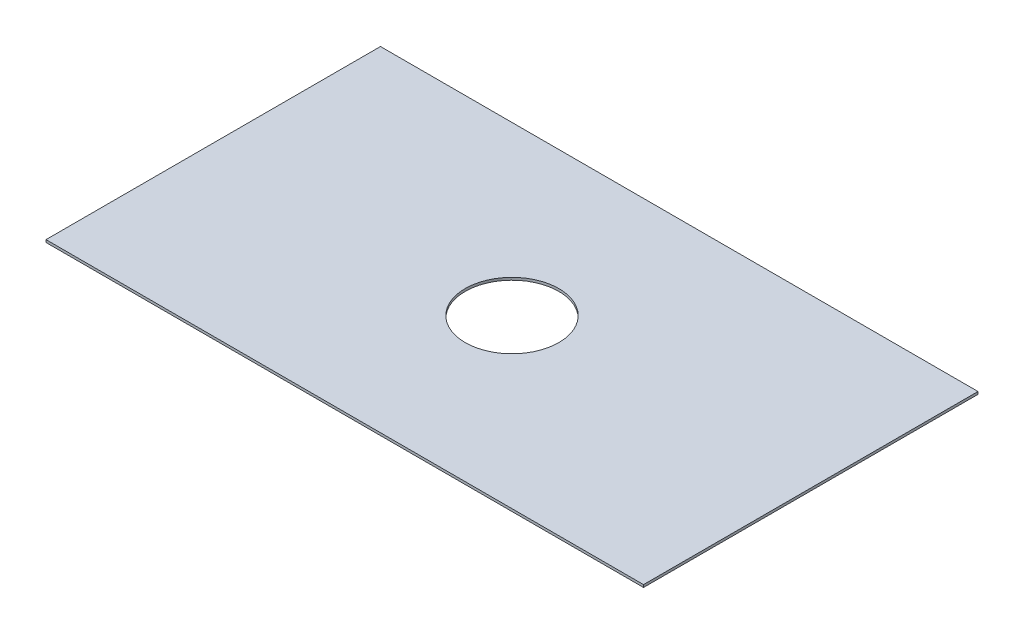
ISO-10303-21;
HEADER;
FILE_DESCRIPTION(('STEP AP214'),'2;1');
FILE_NAME('part.step','',(''),(''),'','','');
FILE_SCHEMA(('AUTOMOTIVE_DESIGN { 1 0 10303 214 1 1 1 1 }'));
ENDSEC;
DATA;
#1=APPLICATION_CONTEXT('core data for automotive mechanical design processes');
#2=APPLICATION_PROTOCOL_DEFINITION('international standard','automotive_design',2000,#1);
#3=PRODUCT_CONTEXT('',#1,'mechanical');
#4=PRODUCT('Part','Part','',(#3));
#5=PRODUCT_RELATED_PRODUCT_CATEGORY('part','',(#4));
#6=PRODUCT_DEFINITION_FORMATION('','',#4);
#7=PRODUCT_DEFINITION_CONTEXT('part definition',#1,'design');
#8=PRODUCT_DEFINITION('design','',#6,#7);
#9=PRODUCT_DEFINITION_SHAPE('','',#8);
#10=(LENGTH_UNIT() NAMED_UNIT(*) SI_UNIT(.MILLI.,.METRE.));
#11=(NAMED_UNIT(*) PLANE_ANGLE_UNIT() SI_UNIT($,.RADIAN.));
#12=(NAMED_UNIT(*) SI_UNIT($,.STERADIAN.) SOLID_ANGLE_UNIT());
#13=UNCERTAINTY_MEASURE_WITH_UNIT(LENGTH_MEASURE(1.E-05),#10,'distance_accuracy_value','');
#14=(GEOMETRIC_REPRESENTATION_CONTEXT(3) GLOBAL_UNCERTAINTY_ASSIGNED_CONTEXT((#13)) GLOBAL_UNIT_ASSIGNED_CONTEXT((#10,
#11,#12)) REPRESENTATION_CONTEXT('',''));
#15=CARTESIAN_POINT('',(0.,0.,0.));
#16=DIRECTION('',(0.,0.,1.));
#17=DIRECTION('',(1.,0.,0.));
#18=AXIS2_PLACEMENT_3D('',#15,#16,#17);
#19=CARTESIAN_POINT('',(-178.65,1.5,-100.));
#20=DIRECTION('',(0.,1.,0.));
#21=DIRECTION('',(0.,0.,1.));
#22=AXIS2_PLACEMENT_3D('',#19,#20,#21);
#23=PLANE('',#22);
#24=DIRECTION('',(0.,0.,1.));
#25=VECTOR('',#24,1.);
#26=CARTESIAN_POINT('',(-178.65,1.5,-100.));
#27=LINE('',#26,#25);
#28=CARTESIAN_POINT('',(-178.65,1.5,-100.));
#29=VERTEX_POINT('',#28);
#30=CARTESIAN_POINT('',(-178.65,1.5,100.));
#31=VERTEX_POINT('',#30);
#32=EDGE_CURVE('E101',#29,#31,#27,.T.);
#33=ORIENTED_EDGE('',*,*,#32,.T.);
#34=DIRECTION('',(1.,0.,0.));
#35=VECTOR('',#34,1.);
#36=CARTESIAN_POINT('',(-178.65,1.5,100.));
#37=LINE('',#36,#35);
#38=CARTESIAN_POINT('',(178.65,1.5,100.));
#39=VERTEX_POINT('',#38);
#40=EDGE_CURVE('E86',#31,#39,#37,.T.);
#41=ORIENTED_EDGE('',*,*,#40,.T.);
#42=DIRECTION('',(0.,0.,-1.));
#43=VECTOR('',#42,1.);
#44=CARTESIAN_POINT('',(178.65,1.5,-100.));
#45=LINE('',#44,#43);
#46=CARTESIAN_POINT('',(178.65,1.5,-100.));
#47=VERTEX_POINT('',#46);
#48=EDGE_CURVE('E52',#39,#47,#45,.T.);
#49=ORIENTED_EDGE('',*,*,#48,.T.);
#50=DIRECTION('',(-1.,0.,0.));
#51=VECTOR('',#50,1.);
#52=CARTESIAN_POINT('',(-178.65,1.5,-100.));
#53=LINE('',#52,#51);
#54=EDGE_CURVE('E47',#47,#29,#53,.T.);
#55=ORIENTED_EDGE('',*,*,#54,.T.);
#56=EDGE_LOOP('',(#33,#41,#49,#55));
#57=FACE_BOUND('',#56,.T.);
#58=CARTESIAN_POINT('',(0.,1.5,0.));
#59=DIRECTION('',(0.,1.,0.));
#60=DIRECTION('',(0.,0.,1.));
#61=AXIS2_PLACEMENT_3D('',#58,#59,#60);
#62=CIRCLE('',#61,28.);
#63=CARTESIAN_POINT('',(0.,1.5,28.));
#64=VERTEX_POINT('',#63);
#65=EDGE_CURVE('E91',#64,#64,#62,.T.);
#66=ORIENTED_EDGE('',*,*,#65,.F.);
#67=EDGE_LOOP('',(#66));
#68=FACE_BOUND('',#67,.T.);
#69=ADVANCED_FACE('F32',(#57,#68),#23,.T.);
#70=CARTESIAN_POINT('',(-178.65,0.,-100.));
#71=DIRECTION('',(0.,1.,0.));
#72=DIRECTION('',(0.,0.,1.));
#73=AXIS2_PLACEMENT_3D('',#70,#71,#72);
#74=PLANE('',#73);
#75=DIRECTION('',(0.,0.,1.));
#76=VECTOR('',#75,1.);
#77=CARTESIAN_POINT('',(-178.65,0.,-100.));
#78=LINE('',#77,#76);
#79=CARTESIAN_POINT('',(-178.65,0.,-100.));
#80=VERTEX_POINT('',#79);
#81=CARTESIAN_POINT('',(-178.65,0.,100.));
#82=VERTEX_POINT('',#81);
#83=EDGE_CURVE('E78',#80,#82,#78,.T.);
#84=ORIENTED_EDGE('',*,*,#83,.F.);
#85=DIRECTION('',(-1.,0.,0.));
#86=VECTOR('',#85,1.);
#87=CARTESIAN_POINT('',(-178.65,0.,-100.));
#88=LINE('',#87,#86);
#89=CARTESIAN_POINT('',(178.65,0.,-100.));
#90=VERTEX_POINT('',#89);
#91=EDGE_CURVE('E99',#90,#80,#88,.T.);
#92=ORIENTED_EDGE('',*,*,#91,.F.);
#93=DIRECTION('',(0.,0.,-1.));
#94=VECTOR('',#93,1.);
#95=CARTESIAN_POINT('',(178.65,0.,-100.));
#96=LINE('',#95,#94);
#97=CARTESIAN_POINT('',(178.65,0.,100.));
#98=VERTEX_POINT('',#97);
#99=EDGE_CURVE('E79',#98,#90,#96,.T.);
#100=ORIENTED_EDGE('',*,*,#99,.F.);
#101=DIRECTION('',(1.,0.,0.));
#102=VECTOR('',#101,1.);
#103=CARTESIAN_POINT('',(-178.65,0.,100.));
#104=LINE('',#103,#102);
#105=EDGE_CURVE('E73',#82,#98,#104,.T.);
#106=ORIENTED_EDGE('',*,*,#105,.F.);
#107=EDGE_LOOP('',(#84,#92,#100,#106));
#108=FACE_BOUND('',#107,.T.);
#109=CARTESIAN_POINT('',(0.,0.,0.));
#110=DIRECTION('',(0.,1.,0.));
#111=DIRECTION('',(0.,0.,1.));
#112=AXIS2_PLACEMENT_3D('',#109,#110,#111);
#113=CIRCLE('',#112,28.);
#114=CARTESIAN_POINT('',(0.,0.,28.));
#115=VERTEX_POINT('',#114);
#116=EDGE_CURVE('E94',#115,#115,#113,.T.);
#117=ORIENTED_EDGE('',*,*,#116,.T.);
#118=EDGE_LOOP('',(#117));
#119=FACE_BOUND('',#118,.T.);
#120=ADVANCED_FACE('F74',(#108,#119),#74,.F.);
#121=CARTESIAN_POINT('',(-178.65,1.5,-100.));
#122=DIRECTION('',(1.,0.,0.));
#123=DIRECTION('',(0.,0.,-1.));
#124=AXIS2_PLACEMENT_3D('',#121,#122,#123);
#125=PLANE('',#124);
#126=ORIENTED_EDGE('',*,*,#83,.T.);
#127=DIRECTION('',(0.,-1.,0.));
#128=VECTOR('',#127,1.);
#129=CARTESIAN_POINT('',(-178.65,1.5,100.));
#130=LINE('',#129,#128);
#131=EDGE_CURVE('E11',#31,#82,#130,.T.);
#132=ORIENTED_EDGE('',*,*,#131,.F.);
#133=ORIENTED_EDGE('',*,*,#32,.F.);
#134=DIRECTION('',(0.,-1.,0.));
#135=VECTOR('',#134,1.);
#136=CARTESIAN_POINT('',(-178.65,1.5,-100.));
#137=LINE('',#136,#135);
#138=EDGE_CURVE('E90',#29,#80,#137,.T.);
#139=ORIENTED_EDGE('',*,*,#138,.T.);
#140=EDGE_LOOP('',(#126,#132,#133,#139));
#141=FACE_BOUND('',#140,.T.);
#142=ADVANCED_FACE('F34',(#141),#125,.F.);
#143=CARTESIAN_POINT('',(-178.65,1.5,100.));
#144=DIRECTION('',(0.,0.,-1.));
#145=DIRECTION('',(-1.,0.,0.));
#146=AXIS2_PLACEMENT_3D('',#143,#144,#145);
#147=PLANE('',#146);
#148=ORIENTED_EDGE('',*,*,#105,.T.);
#149=DIRECTION('',(0.,-1.,0.));
#150=VECTOR('',#149,1.);
#151=CARTESIAN_POINT('',(178.65,1.5,100.));
#152=LINE('',#151,#150);
#153=EDGE_CURVE('E40',#39,#98,#152,.T.);
#154=ORIENTED_EDGE('',*,*,#153,.F.);
#155=ORIENTED_EDGE('',*,*,#40,.F.);
#156=ORIENTED_EDGE('',*,*,#131,.T.);
#157=EDGE_LOOP('',(#148,#154,#155,#156));
#158=FACE_BOUND('',#157,.T.);
#159=ADVANCED_FACE('F85',(#158),#147,.F.);
#160=CARTESIAN_POINT('',(178.65,1.5,-100.));
#161=DIRECTION('',(-1.,0.,0.));
#162=DIRECTION('',(0.,0.,1.));
#163=AXIS2_PLACEMENT_3D('',#160,#161,#162);
#164=PLANE('',#163);
#165=ORIENTED_EDGE('',*,*,#99,.T.);
#166=DIRECTION('',(0.,-1.,0.));
#167=VECTOR('',#166,1.);
#168=CARTESIAN_POINT('',(178.65,1.5,-100.));
#169=LINE('',#168,#167);
#170=EDGE_CURVE('E107',#47,#90,#169,.T.);
#171=ORIENTED_EDGE('',*,*,#170,.F.);
#172=ORIENTED_EDGE('',*,*,#48,.F.);
#173=ORIENTED_EDGE('',*,*,#153,.T.);
#174=EDGE_LOOP('',(#165,#171,#172,#173));
#175=FACE_BOUND('',#174,.T.);
#176=ADVANCED_FACE('F110',(#175),#164,.F.);
#177=CARTESIAN_POINT('',(-178.65,1.5,-100.));
#178=DIRECTION('',(0.,0.,1.));
#179=DIRECTION('',(1.,0.,0.));
#180=AXIS2_PLACEMENT_3D('',#177,#178,#179);
#181=PLANE('',#180);
#182=ORIENTED_EDGE('',*,*,#91,.T.);
#183=ORIENTED_EDGE('',*,*,#138,.F.);
#184=ORIENTED_EDGE('',*,*,#54,.F.);
#185=ORIENTED_EDGE('',*,*,#170,.T.);
#186=EDGE_LOOP('',(#182,#183,#184,#185));
#187=FACE_BOUND('',#186,.T.);
#188=ADVANCED_FACE('F112',(#187),#181,.F.);
#189=CARTESIAN_POINT('',(0.,1.5,0.));
#190=DIRECTION('',(0.,-1.,0.));
#191=DIRECTION('',(0.,0.,-1.));
#192=AXIS2_PLACEMENT_3D('',#189,#190,#191);
#193=CYLINDRICAL_SURFACE('',#192,28.);
#194=ORIENTED_EDGE('',*,*,#65,.T.);
#195=EDGE_LOOP('',(#194));
#196=FACE_BOUND('',#195,.T.);
#197=ORIENTED_EDGE('',*,*,#116,.F.);
#198=EDGE_LOOP('',(#197));
#199=FACE_BOUND('',#198,.T.);
#200=ADVANCED_FACE('F118',(#196,#199),#193,.F.);
#201=CLOSED_SHELL('',(#69,#120,#142,#159,#176,#188,#200));
#202=MANIFOLD_SOLID_BREP('B2',#201);
#203=ADVANCED_BREP_SHAPE_REPRESENTATION('',(#18,#202),#14);
#204=SHAPE_DEFINITION_REPRESENTATION(#9,#203);
ENDSEC;
END-ISO-10303-21;
